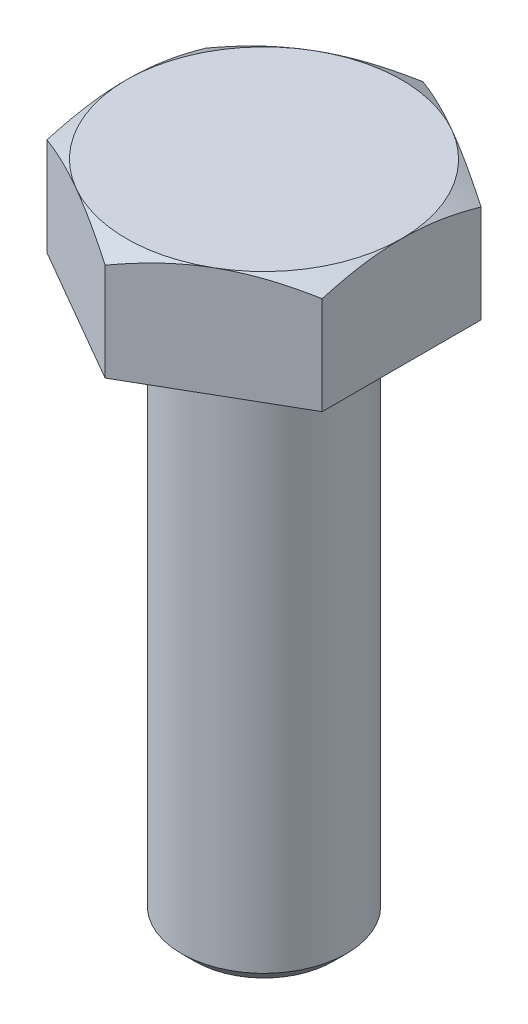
from build123d import *

# Parameters (mm, degrees)
EXTRUDE_1_DEPTH = 4
SKETCH_3_R      = 3
EXTRUDE_2_DEPTH = 20
CHAMFER_1_SIZE  = 0.5


with BuildPart() as part:
    # Sketch 1 → Extrude 1 (new body)
    with BuildSketch(Plane(origin=(0, 0, 0), x_dir=(1, 0, 0), z_dir=(0, 1, 0))):
        Polygon((0, 5.773502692), (-5, 2.886751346), (-5, -2.886751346), (0, -5.773502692), (5, -2.886751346), (5, 2.886751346), align=None)
    extrude(amount=EXTRUDE_1_DEPTH)

    # Sketch 2 → Cut-Revolve 1 (revolve, cut)
    with BuildSketch(Plane(origin=(0, 0, 0), x_dir=(0, 0, -1), z_dir=(1, 0, 0))):
        Polygon((5.773502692, 4), (5, 4), (5.773502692, 3.553418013), align=None)
    revolve(axis=Axis((0, 0, 0), (0, 1, 0)), mode=Mode.SUBTRACT)

    # Sketch 3 → Extrude 2 (add)
    with BuildSketch(Plane(origin=(0, 0, 0), x_dir=(1, 0, 0), z_dir=(0, 1, 0))):
        with Locations(Location((0, 0, 0), (0, 0, 270))):
            Circle(SKETCH_3_R)
    extrude(amount=-EXTRUDE_2_DEPTH)

    # Chamfer 1
    chamfer_1_edges = [part.edges().sort_by_distance(p)[0] for p in [
        (0, -20, -3),
    ]]
    chamfer(chamfer_1_edges, length=CHAMFER_1_SIZE)


solid = part.part
